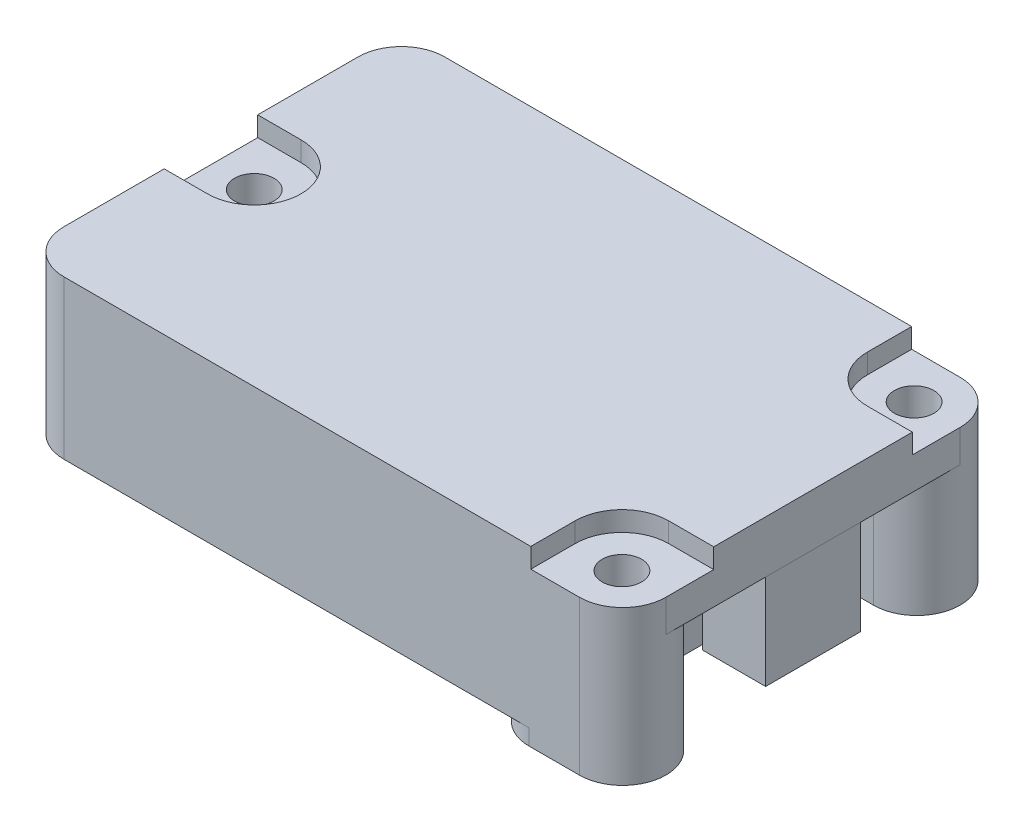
from build123d import *

# Parameters (mm, degrees)
SKIZZE1_R                       = 1.25
AUFSATZ_LINEAR_AUSTRAGEN1_DEPTH = 11
SCHNITT_LINEAR_AUSTRAGEN1_DEPTH = 1.25
SKIZZE3_OUTSIDE_W               = 49.38
SKIZZE3_OUTSIDE_H               = 35.38
SKIZZE3_OUTSIDE_R               = 2.75
SCHNITT_LINEAR_AUSTRAGEN2_DEPTH = 1
SCHNITT_LINEAR_AUSTRAGEN3_DEPTH = 6.7
SKIZZE5_W                       = 4
SKIZZE5_H                       = 6
AUFSATZ_LINEAR_AUSTRAGEN2_DEPTH = 6


with BuildPart() as part:
    # Skizze1 → Aufsatz-Linear austragen1 (new body)
    with BuildSketch(Plane(origin=(0, 0, 0), x_dir=(1, 0, 0), z_dir=(0, 1, 0))):
        with BuildLine():
            Line((-19.05, -9.31), (-19.05, 9.31))
            ThreePointArc((-19.05, 9.31), (-18.24747258, 11.24747258), (-16.31, 12.05))
            Line((-16.31, 12.05), (16.31, 12.05))
            ThreePointArc((16.31, 12.05), (18.24747258, 11.24747258), (19.05, 9.31))
            Line((19.05, 9.31), (19.05, -9.31))
            ThreePointArc((19.05, -9.31), (18.24747258, -11.24747258), (16.31, -12.05))
            Line((16.31, -12.05), (-16.31, -12.05))
            ThreePointArc((-16.31, -12.05), (-18.24747258, -11.24747258), (-19.05, -9.31))
        make_face()
        with Locations(Location((16.2, 9.245, 0), (0, 0, 270))):
            Circle(SKIZZE1_R, mode=Mode.SUBTRACT)
        with Locations(Location((16.2, -9.245, 0), (0, 0, 90))):
            Circle(SKIZZE1_R, mode=Mode.SUBTRACT)
        with Locations(Location((-16.31, 0, 0), (0, 0, 270))):
            Circle(SKIZZE1_R, mode=Mode.SUBTRACT)
    extrude(amount=AUFSATZ_LINEAR_AUSTRAGEN1_DEPTH)

    # Skizze2 → Schnitt-Linear austragen1 (cut)
    with BuildSketch(Plane(origin=(0, 11, 0), x_dir=(1, 0, 0), z_dir=(0, 1, 0))):
        with BuildLine():
            Line((-19.05, -2.96), (-19.05, 2.96))
            Line((-19.05, 2.96), (-16.31, 2.96))
            ThreePointArc((-16.31, 2.96), (-13.35, 0), (-16.31, -2.96))
            Line((-16.31, -2.96), (-19.05, -2.96))
        make_face()
        with BuildLine():
            Line((13.24, 12.05), (13.24, 9.245))
            ThreePointArc((13.24, 9.245), (14.106963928, 7.151963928), (16.2, 6.285))
            Line((16.2, 6.285), (19.05, 6.285))
            Line((19.05, 6.285), (19.05, 12.05))
            Line((19.05, 12.05), (13.24, 12.05))
        make_face()
        with BuildLine():
            Line((19.05, -12.05), (13.24, -12.05))
            Line((13.24, -12.05), (13.24, -9.245))
            ThreePointArc((13.24, -9.245), (14.106963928, -7.151963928), (16.2, -6.285))
            Line((16.2, -6.285), (19.05, -6.285))
            Line((19.05, -6.285), (19.05, -12.05))
        make_face()
    extrude(amount=-SCHNITT_LINEAR_AUSTRAGEN1_DEPTH, mode=Mode.SUBTRACT)

    # Skizze3 outside → Schnitt-Linear austragen2 (cut)
    with BuildSketch(Plane.XZ):
        Rectangle(SKIZZE3_OUTSIDE_W, SKIZZE3_OUTSIDE_H)
        with Locations((-16.31, 0)):
            Circle(SKIZZE3_OUTSIDE_R, mode=Mode.SUBTRACT)
        with BuildLine():
            Line((13.14, 12.05), (16.31, 12.05))
            ThreePointArc((16.31, 12.05), (19.05, 9.31), (16.31, 6.57))
            Line((16.31, 6.57), (13.14, 6.57))
            ThreePointArc((13.14, 6.57), (10.4, 9.31), (13.14, 12.05))
        make_face(mode=Mode.SUBTRACT)
        with BuildLine():
            Line((13.14, -12.05), (16.31, -12.05))
            ThreePointArc((16.31, -12.05), (19.05, -9.31), (16.31, -6.57))
            Line((16.31, -6.57), (13.14, -6.57))
            ThreePointArc((13.14, -6.57), (10.4, -9.31), (13.14, -12.05))
        make_face(mode=Mode.SUBTRACT)
    extrude(amount=-SCHNITT_LINEAR_AUSTRAGEN2_DEPTH, mode=Mode.SUBTRACT)

    # Skizze4 → Schnitt-Linear austragen3 (cut)
    with BuildSketch(Plane.XZ.offset(-1)):
        with BuildLine():
            Line((16.31, 6.57), (15.05, 6.57))
            ThreePointArc((15.05, 6.57), (14.342893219, 6.277106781), (14.05, 5.57))
            Line((14.05, 5.57), (14.05, -5.57))
            ThreePointArc((14.05, -5.57), (14.342893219, -6.277106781), (15.05, -6.57))
            Line((15.05, -6.57), (16.31, -6.57))
            ThreePointArc((16.31, -6.57), (18.24747258, -7.37252742), (19.05, -9.31))
            Line((19.05, -9.31), (19.05, 9.31))
            ThreePointArc((19.05, 9.31), (18.24747258, 7.37252742), (16.31, 6.57))
        make_face()
    extrude(amount=-SCHNITT_LINEAR_AUSTRAGEN3_DEPTH, mode=Mode.SUBTRACT)

    # Skizze5 → Aufsatz-Linear austragen2 (add)
    with BuildSketch(Plane.XZ.offset(-7.7)):
        with Locations((17.049, 0)):
            Rectangle(SKIZZE5_W, SKIZZE5_H)
    extrude(amount=AUFSATZ_LINEAR_AUSTRAGEN2_DEPTH)


solid = part.part
